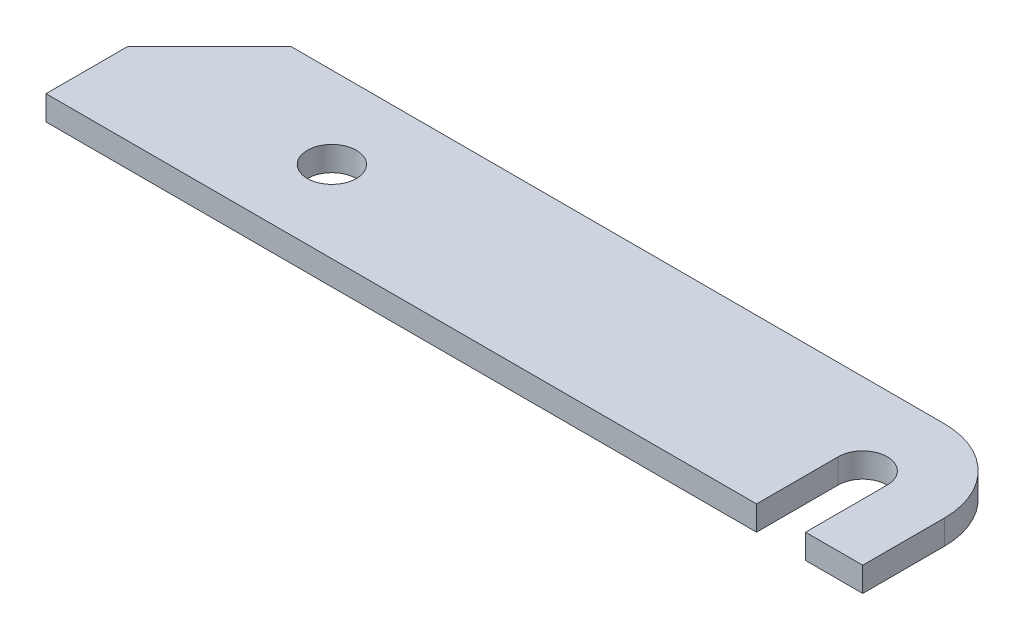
ISO-10303-21;
HEADER;
FILE_DESCRIPTION(('STEP AP214'),'2;1');
FILE_NAME('part.step','',(''),(''),'','','');
FILE_SCHEMA(('AUTOMOTIVE_DESIGN { 1 0 10303 214 1 1 1 1 }'));
ENDSEC;
DATA;
#1=APPLICATION_CONTEXT('core data for automotive mechanical design processes');
#2=APPLICATION_PROTOCOL_DEFINITION('international standard','automotive_design',2000,#1);
#3=PRODUCT_CONTEXT('',#1,'mechanical');
#4=PRODUCT('Part','Part','',(#3));
#5=PRODUCT_RELATED_PRODUCT_CATEGORY('part','',(#4));
#6=PRODUCT_DEFINITION_FORMATION('','',#4);
#7=PRODUCT_DEFINITION_CONTEXT('part definition',#1,'design');
#8=PRODUCT_DEFINITION('design','',#6,#7);
#9=PRODUCT_DEFINITION_SHAPE('','',#8);
#10=(LENGTH_UNIT() NAMED_UNIT(*) SI_UNIT(.MILLI.,.METRE.));
#11=(NAMED_UNIT(*) PLANE_ANGLE_UNIT() SI_UNIT($,.RADIAN.));
#12=(NAMED_UNIT(*) SI_UNIT($,.STERADIAN.) SOLID_ANGLE_UNIT());
#13=UNCERTAINTY_MEASURE_WITH_UNIT(LENGTH_MEASURE(1.E-05),#10,'distance_accuracy_value','');
#14=(GEOMETRIC_REPRESENTATION_CONTEXT(3) GLOBAL_UNCERTAINTY_ASSIGNED_CONTEXT((#13)) GLOBAL_UNIT_ASSIGNED_CONTEXT((#10,
#11,#12)) REPRESENTATION_CONTEXT('',''));
#15=CARTESIAN_POINT('',(0.,0.,0.));
#16=DIRECTION('',(0.,0.,1.));
#17=DIRECTION('',(1.,0.,0.));
#18=AXIS2_PLACEMENT_3D('',#15,#16,#17);
#19=CARTESIAN_POINT('',(90.,3.,-10.));
#20=DIRECTION('',(0.,1.,0.));
#21=DIRECTION('',(0.,0.,1.));
#22=AXIS2_PLACEMENT_3D('',#19,#20,#21);
#23=PLANE('',#22);
#24=DIRECTION('',(0.,0.,1.));
#25=VECTOR('',#24,1.);
#26=CARTESIAN_POINT('',(0.,3.,0.));
#27=LINE('',#26,#25);
#28=CARTESIAN_POINT('',(0.,3.,-10.));
#29=VERTEX_POINT('',#28);
#30=CARTESIAN_POINT('',(0.,3.,0.));
#31=VERTEX_POINT('',#30);
#32=EDGE_CURVE('E148',#29,#31,#27,.T.);
#33=ORIENTED_EDGE('',*,*,#32,.T.);
#34=DIRECTION('',(1.,0.,0.));
#35=VECTOR('',#34,1.);
#36=CARTESIAN_POINT('',(0.,3.,0.));
#37=LINE('',#36,#35);
#38=CARTESIAN_POINT('',(87.,3.,0.));
#39=VERTEX_POINT('',#38);
#40=EDGE_CURVE('E121',#31,#39,#37,.T.);
#41=ORIENTED_EDGE('',*,*,#40,.T.);
#42=DIRECTION('',(0.,0.,-1.));
#43=VECTOR('',#42,1.);
#44=CARTESIAN_POINT('',(87.,3.,-10.));
#45=LINE('',#44,#43);
#46=CARTESIAN_POINT('',(87.,3.,-10.));
#47=VERTEX_POINT('',#46);
#48=EDGE_CURVE('E151',#39,#47,#45,.T.);
#49=ORIENTED_EDGE('',*,*,#48,.T.);
#50=CARTESIAN_POINT('',(90.,3.,-10.));
#51=DIRECTION('',(0.,-1.,0.));
#52=DIRECTION('',(0.,0.,1.));
#53=AXIS2_PLACEMENT_3D('',#50,#51,#52);
#54=CIRCLE('',#53,3.);
#55=CARTESIAN_POINT('',(93.,3.,-10.));
#56=VERTEX_POINT('',#55);
#57=EDGE_CURVE('E153',#47,#56,#54,.T.);
#58=ORIENTED_EDGE('',*,*,#57,.T.);
#59=DIRECTION('',(0.,0.,1.));
#60=VECTOR('',#59,1.);
#61=CARTESIAN_POINT('',(93.,3.,-10.));
#62=LINE('',#61,#60);
#63=CARTESIAN_POINT('',(93.,3.,0.));
#64=VERTEX_POINT('',#63);
#65=EDGE_CURVE('E155',#56,#64,#62,.T.);
#66=ORIENTED_EDGE('',*,*,#65,.T.);
#67=DIRECTION('',(1.,0.,0.));
#68=VECTOR('',#67,1.);
#69=CARTESIAN_POINT('',(93.,3.,0.));
#70=LINE('',#69,#68);
#71=CARTESIAN_POINT('',(100.,3.,0.));
#72=VERTEX_POINT('',#71);
#73=EDGE_CURVE('E157',#64,#72,#70,.T.);
#74=ORIENTED_EDGE('',*,*,#73,.T.);
#75=DIRECTION('',(0.,0.,-1.));
#76=VECTOR('',#75,1.);
#77=CARTESIAN_POINT('',(100.,3.,0.));
#78=LINE('',#77,#76);
#79=CARTESIAN_POINT('',(100.,3.,-10.));
#80=VERTEX_POINT('',#79);
#81=EDGE_CURVE('E159',#72,#80,#78,.T.);
#82=ORIENTED_EDGE('',*,*,#81,.T.);
#83=CARTESIAN_POINT('',(90.,3.,-10.));
#84=DIRECTION('',(0.,1.,0.));
#85=DIRECTION('',(0.,0.,1.));
#86=AXIS2_PLACEMENT_3D('',#83,#84,#85);
#87=CIRCLE('',#86,10.);
#88=CARTESIAN_POINT('',(90.,3.,-20.));
#89=VERTEX_POINT('',#88);
#90=EDGE_CURVE('E161',#80,#89,#87,.T.);
#91=ORIENTED_EDGE('',*,*,#90,.T.);
#92=DIRECTION('',(-1.,0.,0.));
#93=VECTOR('',#92,1.);
#94=CARTESIAN_POINT('',(10.,3.,-20.));
#95=LINE('',#94,#93);
#96=CARTESIAN_POINT('',(10.,3.,-20.));
#97=VERTEX_POINT('',#96);
#98=EDGE_CURVE('E50',#89,#97,#95,.T.);
#99=ORIENTED_EDGE('',*,*,#98,.T.);
#100=DIRECTION('',(-0.707106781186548,0.,0.707106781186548));
#101=VECTOR('',#100,1.);
#102=CARTESIAN_POINT('',(0.,3.,-10.));
#103=LINE('',#102,#101);
#104=EDGE_CURVE('E45',#97,#29,#103,.T.);
#105=ORIENTED_EDGE('',*,*,#104,.T.);
#106=EDGE_LOOP('',(#33,#41,#49,#58,#66,#74,#82,#91,#99,#105));
#107=FACE_BOUND('',#106,.T.);
#108=CARTESIAN_POINT('',(25.,3.,-10.));
#109=DIRECTION('',(0.,1.,0.));
#110=DIRECTION('',(0.,0.,1.));
#111=AXIS2_PLACEMENT_3D('',#108,#109,#110);
#112=CIRCLE('',#111,3.);
#113=CARTESIAN_POINT('',(25.,3.,-7.));
#114=VERTEX_POINT('',#113);
#115=EDGE_CURVE('E126',#114,#114,#112,.T.);
#116=ORIENTED_EDGE('',*,*,#115,.F.);
#117=EDGE_LOOP('',(#116));
#118=FACE_BOUND('',#117,.T.);
#119=ADVANCED_FACE('F30',(#107,#118),#23,.T.);
#120=CARTESIAN_POINT('',(90.,0.,-10.));
#121=DIRECTION('',(0.,1.,0.));
#122=DIRECTION('',(0.,0.,1.));
#123=AXIS2_PLACEMENT_3D('',#120,#121,#122);
#124=PLANE('',#123);
#125=DIRECTION('',(0.,0.,1.));
#126=VECTOR('',#125,1.);
#127=CARTESIAN_POINT('',(0.,0.,0.));
#128=LINE('',#127,#126);
#129=CARTESIAN_POINT('',(0.,0.,-10.));
#130=VERTEX_POINT('',#129);
#131=CARTESIAN_POINT('',(0.,0.,0.));
#132=VERTEX_POINT('',#131);
#133=EDGE_CURVE('E112',#130,#132,#128,.T.);
#134=ORIENTED_EDGE('',*,*,#133,.F.);
#135=DIRECTION('',(-0.707106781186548,0.,0.707106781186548));
#136=VECTOR('',#135,1.);
#137=CARTESIAN_POINT('',(0.,0.,-10.));
#138=LINE('',#137,#136);
#139=CARTESIAN_POINT('',(10.,0.,-20.));
#140=VERTEX_POINT('',#139);
#141=EDGE_CURVE('E146',#140,#130,#138,.T.);
#142=ORIENTED_EDGE('',*,*,#141,.F.);
#143=DIRECTION('',(-1.,0.,0.));
#144=VECTOR('',#143,1.);
#145=CARTESIAN_POINT('',(10.,0.,-20.));
#146=LINE('',#145,#144);
#147=CARTESIAN_POINT('',(90.,0.,-20.));
#148=VERTEX_POINT('',#147);
#149=EDGE_CURVE('E144',#148,#140,#146,.T.);
#150=ORIENTED_EDGE('',*,*,#149,.F.);
#151=CARTESIAN_POINT('',(90.,0.,-10.));
#152=DIRECTION('',(0.,1.,0.));
#153=DIRECTION('',(0.,0.,1.));
#154=AXIS2_PLACEMENT_3D('',#151,#152,#153);
#155=CIRCLE('',#154,10.);
#156=CARTESIAN_POINT('',(100.,0.,-10.));
#157=VERTEX_POINT('',#156);
#158=EDGE_CURVE('E142',#157,#148,#155,.T.);
#159=ORIENTED_EDGE('',*,*,#158,.F.);
#160=DIRECTION('',(0.,0.,-1.));
#161=VECTOR('',#160,1.);
#162=CARTESIAN_POINT('',(100.,0.,0.));
#163=LINE('',#162,#161);
#164=CARTESIAN_POINT('',(100.,0.,0.));
#165=VERTEX_POINT('',#164);
#166=EDGE_CURVE('E140',#165,#157,#163,.T.);
#167=ORIENTED_EDGE('',*,*,#166,.F.);
#168=DIRECTION('',(1.,0.,0.));
#169=VECTOR('',#168,1.);
#170=CARTESIAN_POINT('',(93.,0.,0.));
#171=LINE('',#170,#169);
#172=CARTESIAN_POINT('',(93.,0.,0.));
#173=VERTEX_POINT('',#172);
#174=EDGE_CURVE('E138',#173,#165,#171,.T.);
#175=ORIENTED_EDGE('',*,*,#174,.F.);
#176=DIRECTION('',(0.,0.,1.));
#177=VECTOR('',#176,1.);
#178=CARTESIAN_POINT('',(93.,0.,-10.));
#179=LINE('',#178,#177);
#180=CARTESIAN_POINT('',(93.,0.,-10.));
#181=VERTEX_POINT('',#180);
#182=EDGE_CURVE('E136',#181,#173,#179,.T.);
#183=ORIENTED_EDGE('',*,*,#182,.F.);
#184=CARTESIAN_POINT('',(90.,0.,-10.));
#185=DIRECTION('',(0.,-1.,0.));
#186=DIRECTION('',(0.,0.,1.));
#187=AXIS2_PLACEMENT_3D('',#184,#185,#186);
#188=CIRCLE('',#187,3.);
#189=CARTESIAN_POINT('',(87.,0.,-10.));
#190=VERTEX_POINT('',#189);
#191=EDGE_CURVE('E134',#190,#181,#188,.T.);
#192=ORIENTED_EDGE('',*,*,#191,.F.);
#193=DIRECTION('',(0.,0.,-1.));
#194=VECTOR('',#193,1.);
#195=CARTESIAN_POINT('',(87.,0.,-10.));
#196=LINE('',#195,#194);
#197=CARTESIAN_POINT('',(87.,0.,0.));
#198=VERTEX_POINT('',#197);
#199=EDGE_CURVE('E114',#198,#190,#196,.T.);
#200=ORIENTED_EDGE('',*,*,#199,.F.);
#201=DIRECTION('',(1.,0.,0.));
#202=VECTOR('',#201,1.);
#203=CARTESIAN_POINT('',(0.,0.,0.));
#204=LINE('',#203,#202);
#205=EDGE_CURVE('E107',#132,#198,#204,.T.);
#206=ORIENTED_EDGE('',*,*,#205,.F.);
#207=EDGE_LOOP('',(#134,#142,#150,#159,#167,#175,#183,#192,#200,#206));
#208=FACE_BOUND('',#207,.T.);
#209=CARTESIAN_POINT('',(25.,0.,-10.));
#210=DIRECTION('',(0.,1.,0.));
#211=DIRECTION('',(0.,0.,1.));
#212=AXIS2_PLACEMENT_3D('',#209,#210,#211);
#213=CIRCLE('',#212,3.);
#214=CARTESIAN_POINT('',(25.,0.,-7.));
#215=VERTEX_POINT('',#214);
#216=EDGE_CURVE('E129',#215,#215,#213,.T.);
#217=ORIENTED_EDGE('',*,*,#216,.T.);
#218=EDGE_LOOP('',(#217));
#219=FACE_BOUND('',#218,.T.);
#220=ADVANCED_FACE('F108',(#208,#219),#124,.F.);
#221=CARTESIAN_POINT('',(0.,3.,0.));
#222=DIRECTION('',(1.,0.,0.));
#223=DIRECTION('',(0.,0.,-1.));
#224=AXIS2_PLACEMENT_3D('',#221,#222,#223);
#225=PLANE('',#224);
#226=ORIENTED_EDGE('',*,*,#133,.T.);
#227=DIRECTION('',(0.,-1.,0.));
#228=VECTOR('',#227,1.);
#229=CARTESIAN_POINT('',(0.,3.,0.));
#230=LINE('',#229,#228);
#231=EDGE_CURVE('E11',#31,#132,#230,.T.);
#232=ORIENTED_EDGE('',*,*,#231,.F.);
#233=ORIENTED_EDGE('',*,*,#32,.F.);
#234=DIRECTION('',(0.,-1.,0.));
#235=VECTOR('',#234,1.);
#236=CARTESIAN_POINT('',(0.,3.,-10.));
#237=LINE('',#236,#235);
#238=EDGE_CURVE('E125',#29,#130,#237,.T.);
#239=ORIENTED_EDGE('',*,*,#238,.T.);
#240=EDGE_LOOP('',(#226,#232,#233,#239));
#241=FACE_BOUND('',#240,.T.);
#242=ADVANCED_FACE('F32',(#241),#225,.F.);
#243=CARTESIAN_POINT('',(0.,3.,0.));
#244=DIRECTION('',(0.,0.,-1.));
#245=DIRECTION('',(-1.,0.,0.));
#246=AXIS2_PLACEMENT_3D('',#243,#244,#245);
#247=PLANE('',#246);
#248=ORIENTED_EDGE('',*,*,#205,.T.);
#249=DIRECTION('',(0.,-1.,0.));
#250=VECTOR('',#249,1.);
#251=CARTESIAN_POINT('',(87.,3.,0.));
#252=LINE('',#251,#250);
#253=EDGE_CURVE('E38',#39,#198,#252,.T.);
#254=ORIENTED_EDGE('',*,*,#253,.F.);
#255=ORIENTED_EDGE('',*,*,#40,.F.);
#256=ORIENTED_EDGE('',*,*,#231,.T.);
#257=EDGE_LOOP('',(#248,#254,#255,#256));
#258=FACE_BOUND('',#257,.T.);
#259=ADVANCED_FACE('F120',(#258),#247,.F.);
#260=CARTESIAN_POINT('',(87.,3.,-10.));
#261=DIRECTION('',(-1.,0.,0.));
#262=DIRECTION('',(0.,0.,1.));
#263=AXIS2_PLACEMENT_3D('',#260,#261,#262);
#264=PLANE('',#263);
#265=ORIENTED_EDGE('',*,*,#199,.T.);
#266=DIRECTION('',(0.,-1.,0.));
#267=VECTOR('',#266,1.);
#268=CARTESIAN_POINT('',(87.,3.,-10.));
#269=LINE('',#268,#267);
#270=EDGE_CURVE('E184',#47,#190,#269,.T.);
#271=ORIENTED_EDGE('',*,*,#270,.F.);
#272=ORIENTED_EDGE('',*,*,#48,.F.);
#273=ORIENTED_EDGE('',*,*,#253,.T.);
#274=EDGE_LOOP('',(#265,#271,#272,#273));
#275=FACE_BOUND('',#274,.T.);
#276=ADVANCED_FACE('F188',(#275),#264,.F.);
#277=CARTESIAN_POINT('',(90.,3.,-10.));
#278=DIRECTION('',(0.,-1.,0.));
#279=DIRECTION('',(0.,0.,-1.));
#280=AXIS2_PLACEMENT_3D('',#277,#278,#279);
#281=CYLINDRICAL_SURFACE('',#280,3.);
#282=ORIENTED_EDGE('',*,*,#191,.T.);
#283=DIRECTION('',(0.,-1.,0.));
#284=VECTOR('',#283,1.);
#285=CARTESIAN_POINT('',(93.,3.,-10.));
#286=LINE('',#285,#284);
#287=EDGE_CURVE('E181',#56,#181,#286,.T.);
#288=ORIENTED_EDGE('',*,*,#287,.F.);
#289=ORIENTED_EDGE('',*,*,#57,.F.);
#290=ORIENTED_EDGE('',*,*,#270,.T.);
#291=EDGE_LOOP('',(#282,#288,#289,#290));
#292=FACE_BOUND('',#291,.T.);
#293=ADVANCED_FACE('F196',(#292),#281,.F.);
#294=CARTESIAN_POINT('',(93.,3.,-10.));
#295=DIRECTION('',(1.,0.,0.));
#296=DIRECTION('',(0.,0.,-1.));
#297=AXIS2_PLACEMENT_3D('',#294,#295,#296);
#298=PLANE('',#297);
#299=ORIENTED_EDGE('',*,*,#182,.T.);
#300=DIRECTION('',(0.,-1.,0.));
#301=VECTOR('',#300,1.);
#302=CARTESIAN_POINT('',(93.,3.,0.));
#303=LINE('',#302,#301);
#304=EDGE_CURVE('E178',#64,#173,#303,.T.);
#305=ORIENTED_EDGE('',*,*,#304,.F.);
#306=ORIENTED_EDGE('',*,*,#65,.F.);
#307=ORIENTED_EDGE('',*,*,#287,.T.);
#308=EDGE_LOOP('',(#299,#305,#306,#307));
#309=FACE_BOUND('',#308,.T.);
#310=ADVANCED_FACE('F199',(#309),#298,.F.);
#311=CARTESIAN_POINT('',(93.,3.,0.));
#312=DIRECTION('',(0.,0.,-1.));
#313=DIRECTION('',(-1.,0.,0.));
#314=AXIS2_PLACEMENT_3D('',#311,#312,#313);
#315=PLANE('',#314);
#316=ORIENTED_EDGE('',*,*,#174,.T.);
#317=DIRECTION('',(0.,-1.,0.));
#318=VECTOR('',#317,1.);
#319=CARTESIAN_POINT('',(100.,3.,0.));
#320=LINE('',#319,#318);
#321=EDGE_CURVE('E175',#72,#165,#320,.T.);
#322=ORIENTED_EDGE('',*,*,#321,.F.);
#323=ORIENTED_EDGE('',*,*,#73,.F.);
#324=ORIENTED_EDGE('',*,*,#304,.T.);
#325=EDGE_LOOP('',(#316,#322,#323,#324));
#326=FACE_BOUND('',#325,.T.);
#327=ADVANCED_FACE('F204',(#326),#315,.F.);
#328=CARTESIAN_POINT('',(100.,3.,0.));
#329=DIRECTION('',(-1.,0.,0.));
#330=DIRECTION('',(0.,0.,1.));
#331=AXIS2_PLACEMENT_3D('',#328,#329,#330);
#332=PLANE('',#331);
#333=ORIENTED_EDGE('',*,*,#166,.T.);
#334=DIRECTION('',(0.,-1.,0.));
#335=VECTOR('',#334,1.);
#336=CARTESIAN_POINT('',(100.,3.,-10.));
#337=LINE('',#336,#335);
#338=EDGE_CURVE('E172',#80,#157,#337,.T.);
#339=ORIENTED_EDGE('',*,*,#338,.F.);
#340=ORIENTED_EDGE('',*,*,#81,.F.);
#341=ORIENTED_EDGE('',*,*,#321,.T.);
#342=EDGE_LOOP('',(#333,#339,#340,#341));
#343=FACE_BOUND('',#342,.T.);
#344=ADVANCED_FACE('F210',(#343),#332,.F.);
#345=CARTESIAN_POINT('',(90.,3.,-10.));
#346=DIRECTION('',(0.,-1.,0.));
#347=DIRECTION('',(0.,0.,-1.));
#348=AXIS2_PLACEMENT_3D('',#345,#346,#347);
#349=CYLINDRICAL_SURFACE('',#348,10.);
#350=ORIENTED_EDGE('',*,*,#158,.T.);
#351=DIRECTION('',(0.,-1.,0.));
#352=VECTOR('',#351,1.);
#353=CARTESIAN_POINT('',(90.,3.,-20.));
#354=LINE('',#353,#352);
#355=EDGE_CURVE('E169',#89,#148,#354,.T.);
#356=ORIENTED_EDGE('',*,*,#355,.F.);
#357=ORIENTED_EDGE('',*,*,#90,.F.);
#358=ORIENTED_EDGE('',*,*,#338,.T.);
#359=EDGE_LOOP('',(#350,#356,#357,#358));
#360=FACE_BOUND('',#359,.T.);
#361=ADVANCED_FACE('F214',(#360),#349,.T.);
#362=CARTESIAN_POINT('',(10.,3.,-20.));
#363=DIRECTION('',(0.,0.,1.));
#364=DIRECTION('',(1.,0.,0.));
#365=AXIS2_PLACEMENT_3D('',#362,#363,#364);
#366=PLANE('',#365);
#367=ORIENTED_EDGE('',*,*,#149,.T.);
#368=DIRECTION('',(0.,-1.,0.));
#369=VECTOR('',#368,1.);
#370=CARTESIAN_POINT('',(10.,3.,-20.));
#371=LINE('',#370,#369);
#372=EDGE_CURVE('E166',#97,#140,#371,.T.);
#373=ORIENTED_EDGE('',*,*,#372,.F.);
#374=ORIENTED_EDGE('',*,*,#98,.F.);
#375=ORIENTED_EDGE('',*,*,#355,.T.);
#376=EDGE_LOOP('',(#367,#373,#374,#375));
#377=FACE_BOUND('',#376,.T.);
#378=ADVANCED_FACE('F217',(#377),#366,.F.);
#379=CARTESIAN_POINT('',(0.,3.,-10.));
#380=DIRECTION('',(0.707106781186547,0.,0.707106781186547));
#381=DIRECTION('',(0.707106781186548,0.,-0.707106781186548));
#382=AXIS2_PLACEMENT_3D('',#379,#380,#381);
#383=PLANE('',#382);
#384=ORIENTED_EDGE('',*,*,#141,.T.);
#385=ORIENTED_EDGE('',*,*,#238,.F.);
#386=ORIENTED_EDGE('',*,*,#104,.F.);
#387=ORIENTED_EDGE('',*,*,#372,.T.);
#388=EDGE_LOOP('',(#384,#385,#386,#387));
#389=FACE_BOUND('',#388,.T.);
#390=ADVANCED_FACE('F219',(#389),#383,.F.);
#391=CARTESIAN_POINT('',(25.,3.,-10.));
#392=DIRECTION('',(0.,-1.,0.));
#393=DIRECTION('',(0.,0.,-1.));
#394=AXIS2_PLACEMENT_3D('',#391,#392,#393);
#395=CYLINDRICAL_SURFACE('',#394,3.);
#396=ORIENTED_EDGE('',*,*,#115,.T.);
#397=EDGE_LOOP('',(#396));
#398=FACE_BOUND('',#397,.T.);
#399=ORIENTED_EDGE('',*,*,#216,.F.);
#400=EDGE_LOOP('',(#399));
#401=FACE_BOUND('',#400,.T.);
#402=ADVANCED_FACE('F221',(#398,#401),#395,.F.);
#403=CLOSED_SHELL('',(#119,#220,#242,#259,#276,#293,#310,#327,#344,#361,#378,#390,#402));
#404=MANIFOLD_SOLID_BREP('B2',#403);
#405=ADVANCED_BREP_SHAPE_REPRESENTATION('',(#18,#404),#14);
#406=SHAPE_DEFINITION_REPRESENTATION(#9,#405);
ENDSEC;
END-ISO-10303-21;
